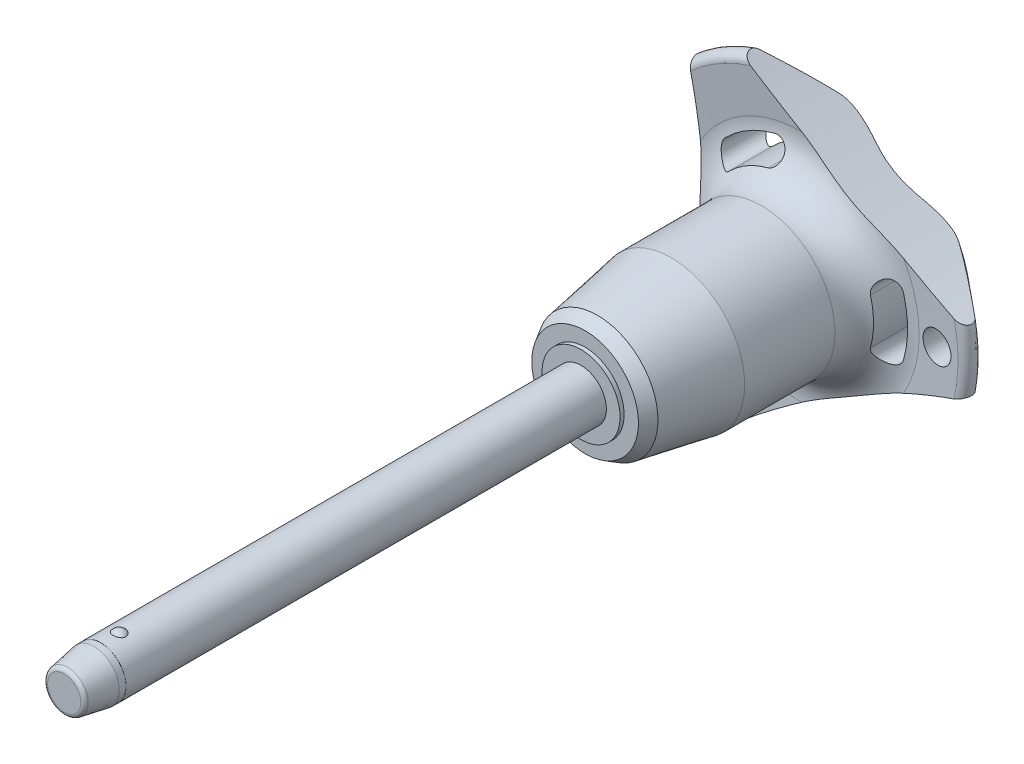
from build123d import *

# Parameters (mm, degrees)
SKETCH1_R           = 2.5
BOSS_EXTRUDE1_DEPTH = 45
SKETCH2_R           = 2.1
BOSS_EXTRUDE2_DEPTH = 26.7
BOSS_EXTRUDE3_START = 6
SKETCH1_2_R         = 2.5
BOSS_EXTRUDE3_DEPTH = 6
CHAMFER1_SIZE       = 3
CHAMFER1_SIZE2      = 0.528980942
FILLET1_R           = 0.4
SKETCH6_R           = 79.96
CUT_EXTRUDE1_DEPTH  = 76.446116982
CIRPATTERN1_COUNT   = 3
SKETCH7_R           = 1.5
CUT_EXTRUDE2_DEPTH  = 76.244100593
SKETCH8_R           = 2.5
SKETCH8_R_2         = 2.49
CUT_EXTRUDE3_DEPTH  = 3.6


with BuildPart() as part:
    # Sketch1 → Boss-Extrude1 (new body)
    with BuildSketch(Plane.XY):
        Circle(SKETCH1_R)
    extrude(amount=-BOSS_EXTRUDE1_DEPTH)

    # Sketch2 → Boss-Extrude2 (add)
    with BuildSketch(Plane(origin=(0, 0, -45), x_dir=(-1, 0, 0), z_dir=(0, 0, -1))):
        Circle(SKETCH2_R)
    extrude(amount=BOSS_EXTRUDE2_DEPTH)

    # Sketch3 → Revolve1 (revolve)
    with BuildSketch(Plane(origin=(0, 0, 0), x_dir=(0, 0, -1), z_dir=(1, 0, 0))):
        with BuildLine():
            Line((-0.580947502, 2.75), (-0.580947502, 1.15))
            ThreePointArc((-0.580947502, 1.15), (0.219052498, 1.95), (-0.580947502, 2.75))
        make_face()
        with BuildLine():
            Line((-0.580947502, -1.15), (-0.580947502, -2.75))
            ThreePointArc((-0.580947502, -2.75), (0.219052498, -1.95), (-0.580947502, -1.15))
        make_face()
    revolve(axis=Axis((0, -1.15, 0.580947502), (0, 1, 0)))

    # Sketch1_2 → Boss-Extrude3 (add)
    with BuildSketch(Plane.XY.offset(BOSS_EXTRUDE3_START)):
        Circle(SKETCH1_2_R)
    extrude(amount=-BOSS_EXTRUDE3_DEPTH)

    # Chamfer1
    chamfer1_edges = [part.edges().sort_by_distance(p)[0] for p in [
        (-2.5, 0, 6),
    ]]
    chamfer1_side = [part.faces().sort_by_distance(p)[0] for p in [
        (-2.5, 0, -19.5),
    ]]
    chamfer(chamfer1_edges, length=CHAMFER1_SIZE, length2=CHAMFER1_SIZE2, reference=chamfer1_side[0])

    # Fillet1
    fillet1_edges = [part.edges().sort_by_distance(p)[0] for p in [
        (-1.971019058, 0, 6),
        (2.1, 0, -71.7),
    ]]
    fillet(fillet1_edges, radius=FILLET1_R)

    # Sketch4 → Revolve2 (revolve)
    with BuildSketch(Plane(origin=(0, 0, 0), x_dir=(0, 0, -1), z_dir=(1, 0, 0)), mode=Mode.PRIVATE) as revolve2_sk:
        Polygon((45, 0), (45, 3.851837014), (45.4, 3.851837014), (45.4, 5.26161122), (46.620900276, 5.966498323), (53.9, 7.25), (62.8, 7.25), (62.8, 0), align=None)
    revolve(revolve2_sk.sketch.rotate(Axis((0, 0, -62.8), (0, 0, 1)), 90), axis=Axis((0, 0, -62.8), (0, 0, 1)))

    # Sketch5 → Revolve3 (revolve)
    with BuildSketch(Plane(origin=(0, 0, 0), x_dir=(0, 0, -1), z_dir=(1, 0, 0)), mode=Mode.PRIVATE) as revolve3_sk:
        with BuildLine():
            Line((66.78715932, 11.570250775), (66.452568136, 15.735949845))
            ThreePointArc((66.452568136, 15.735949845), (66.946485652, 16.540188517), (67.862835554, 16.314230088))
            Line((67.862835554, 16.314230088), (71.326414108, 12.186497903))
            ThreePointArc((71.326414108, 12.186497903), (71.7, 11.109282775), (71.261488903, 10.056825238))
            ThreePointArc((71.261488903, 10.056825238), (68.289873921, 5.413681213), (67.25, 0))
            Line((67.25, 0), (62.8, 0))
            Line((62.8, 0), (62.8, 7.25))
            ThreePointArc((62.8, 7.25), (65.739473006, 8.537160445), (66.78715932, 11.570250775))
        make_face()
    revolve(revolve3_sk.sketch.rotate(Axis((0, 0, -67.25), (0, 0, 1)), 90), axis=Axis((0, 0, -67.25), (0, 0, 1)))

    # Sketch6 → Cut-Extrude1 (cut, through all)
    with BuildSketch(Plane.XY):
        with Locations((-89.76, 0)):
            Circle(SKETCH6_R)
        with BuildLine():
            ThreePointArc((10.099921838, -2.834717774), (10.490188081, 0), (10.099921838, 2.834717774))
            ThreePointArc((10.099921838, 2.834717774), (8.768180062, 3.582738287), (8.020159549, 2.250996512))
            ThreePointArc((8.020159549, 2.250996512), (8.330062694, 0), (8.020159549, -2.250996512))
            ThreePointArc((8.020159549, -2.250996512), (8.768180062, -3.582738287), (10.099921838, -2.834717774))
        make_face()
    cut_extrude1 = extrude(amount=-CUT_EXTRUDE1_DEPTH, mode=Mode.SUBTRACT)

    # CirPattern1: Cut-Extrude1 ×3 about axis
    cirpattern1_axis = Axis((0, 0, 0), (0, 0, 1))
    for i in range(1, CIRPATTERN1_COUNT):
        add(cut_extrude1.rotate(cirpattern1_axis, i * 360 / CIRPATTERN1_COUNT), mode=Mode.SUBTRACT)

    # Sketch7 → Cut-Extrude2 (cut, through all)
    with BuildSketch(Plane.XY):
        with Locations(Location((13.490188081, 0, 0), (0, 0, 225.221865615))):
            Circle(SKETCH7_R)
    extrude(amount=-CUT_EXTRUDE2_DEPTH, mode=Mode.SUBTRACT)

    # Sketch8 → Cut-Extrude3 (cut)
    with BuildSketch(Plane.XY.offset(6)):
        Circle(SKETCH8_R)
        Circle(SKETCH8_R_2, mode=Mode.SUBTRACT)
    extrude(amount=-CUT_EXTRUDE3_DEPTH, mode=Mode.SUBTRACT)


solid = part.part
